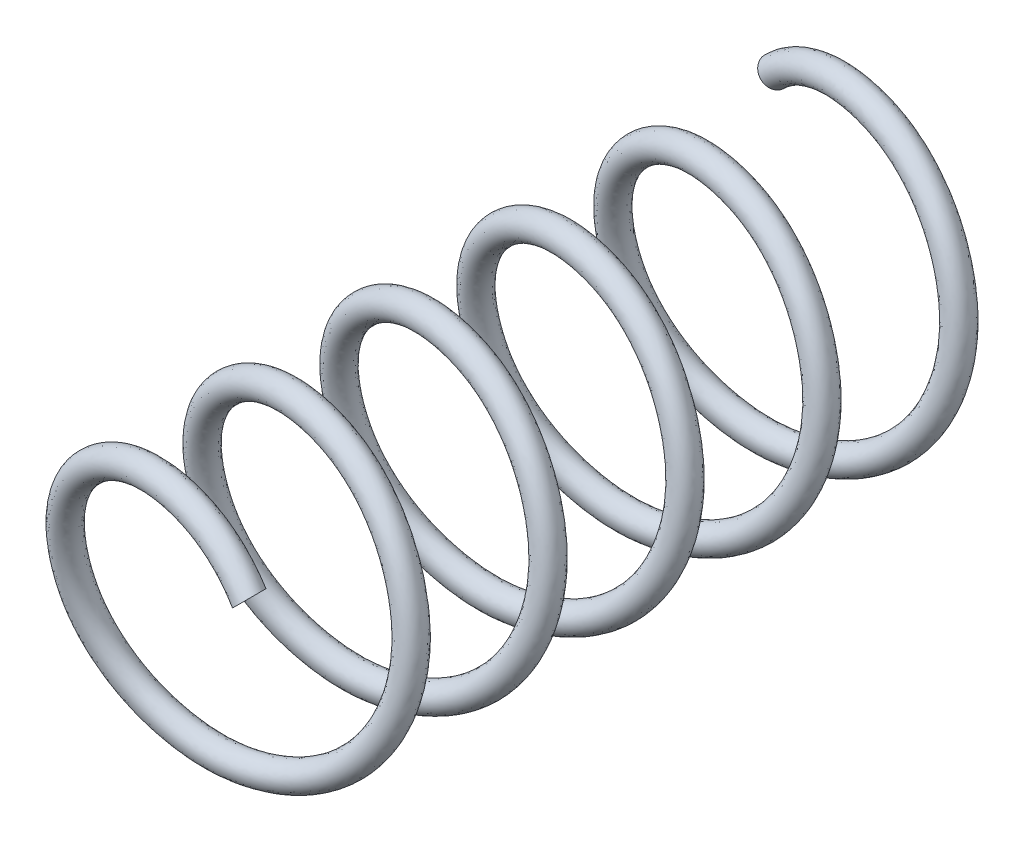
ISO-10303-21;
HEADER;
FILE_DESCRIPTION(('STEP AP214'),'2;1');
FILE_NAME('part.step','',(''),(''),'','','');
FILE_SCHEMA(('AUTOMOTIVE_DESIGN { 1 0 10303 214 1 1 1 1 }'));
ENDSEC;
DATA;
#1=APPLICATION_CONTEXT('core data for automotive mechanical design processes');
#2=APPLICATION_PROTOCOL_DEFINITION('international standard','automotive_design',2000,#1);
#3=PRODUCT_CONTEXT('',#1,'mechanical');
#4=PRODUCT('Part','Part','',(#3));
#5=PRODUCT_RELATED_PRODUCT_CATEGORY('part','',(#4));
#6=PRODUCT_DEFINITION_FORMATION('','',#4);
#7=PRODUCT_DEFINITION_CONTEXT('part definition',#1,'design');
#8=PRODUCT_DEFINITION('design','',#6,#7);
#9=PRODUCT_DEFINITION_SHAPE('','',#8);
#10=(LENGTH_UNIT() NAMED_UNIT(*) SI_UNIT(.MILLI.,.METRE.));
#11=(NAMED_UNIT(*) PLANE_ANGLE_UNIT() SI_UNIT($,.RADIAN.));
#12=(NAMED_UNIT(*) SI_UNIT($,.STERADIAN.) SOLID_ANGLE_UNIT());
#13=UNCERTAINTY_MEASURE_WITH_UNIT(LENGTH_MEASURE(1.E-05),#10,'distance_accuracy_value','');
#14=(GEOMETRIC_REPRESENTATION_CONTEXT(3) GLOBAL_UNCERTAINTY_ASSIGNED_CONTEXT((#13)) GLOBAL_UNIT_ASSIGNED_CONTEXT((#10,
#11,#12)) REPRESENTATION_CONTEXT('',''));
#15=CARTESIAN_POINT('',(0.,0.,0.));
#16=DIRECTION('',(0.,0.,1.));
#17=DIRECTION('',(1.,0.,0.));
#18=AXIS2_PLACEMENT_3D('',#15,#16,#17);
#19=CARTESIAN_POINT('',(-0.777817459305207,0.777817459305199,0.));
#20=DIRECTION('',(0.707106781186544,0.707106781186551,0.));
#21=DIRECTION('',(-0.707106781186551,0.707106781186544,0.));
#22=AXIS2_PLACEMENT_3D('',#19,#20,#21);
#23=PLANE('',#22);
#24=CARTESIAN_POINT('',(-0.636396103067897,0.63639610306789,0.));
#25=CARTESIAN_POINT('',(-0.636396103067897,0.63639610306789,-0.026158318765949));
#26=CARTESIAN_POINT('',(-0.647036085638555,0.647036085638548,-0.1));
#27=CARTESIAN_POINT('',(-0.767177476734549,0.767177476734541,-0.1));
#28=CARTESIAN_POINT('',(-0.777817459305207,0.777817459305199,-0.026158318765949));
#29=CARTESIAN_POINT('',(-0.777817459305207,0.777817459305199,0.0261583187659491));
#30=CARTESIAN_POINT('',(-0.767177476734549,0.767177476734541,0.1));
#31=CARTESIAN_POINT('',(-0.647036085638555,0.647036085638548,0.1));
#32=CARTESIAN_POINT('',(-0.636396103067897,0.63639610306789,0.026158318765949));
#33=CARTESIAN_POINT('',(-0.636396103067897,0.63639610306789,0.));
#34=(BOUNDED_CURVE() B_SPLINE_CURVE(3,(#24,#25,#26,#27,#28,#29,#30,#31,#32,#33),.UNSPECIFIED.,
.T.,.F.) B_SPLINE_CURVE_WITH_KNOTS((4,2,2,2,4),(0.,0.25,0.5,0.75,1.),
.UNSPECIFIED.) CURVE() GEOMETRIC_REPRESENTATION_ITEM() RATIONAL_B_SPLINE_CURVE((1.,1.,
0.68211091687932,0.68211091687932,1.,1.,0.68211091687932,0.68211091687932,1.,1.)) REPRESENTATION_ITEM(''));
#35=CARTESIAN_POINT('',(-0.636396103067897,0.63639610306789,0.));
#36=VERTEX_POINT('',#35);
#37=EDGE_CURVE('E33',#36,#36,#34,.F.);
#38=ORIENTED_EDGE('',*,*,#37,.T.);
#39=EDGE_LOOP('',(#38));
#40=FACE_BOUND('',#39,.T.);
#41=ADVANCED_FACE('F22',(#40),#23,.F.);
#42=CARTESIAN_POINT('',(0.777817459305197,0.77781745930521,5.25));
#43=DIRECTION('',(0.707106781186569,-0.707106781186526,0.));
#44=DIRECTION('',(0.707106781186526,0.707106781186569,0.));
#45=AXIS2_PLACEMENT_3D('',#42,#43,#44);
#46=PLANE('',#45);
#47=CARTESIAN_POINT('',(0.636396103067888,0.636396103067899,5.25));
#48=CARTESIAN_POINT('',(0.636396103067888,0.636396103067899,5.27615831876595));
#49=CARTESIAN_POINT('',(0.647036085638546,0.647036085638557,5.35));
#50=CARTESIAN_POINT('',(0.767177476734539,0.767177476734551,5.35));
#51=CARTESIAN_POINT('',(0.777817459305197,0.77781745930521,5.27615831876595));
#52=CARTESIAN_POINT('',(0.777817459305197,0.77781745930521,5.22384168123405));
#53=CARTESIAN_POINT('',(0.767177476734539,0.767177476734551,5.15));
#54=CARTESIAN_POINT('',(0.647036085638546,0.647036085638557,5.15));
#55=CARTESIAN_POINT('',(0.636396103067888,0.636396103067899,5.22384168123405));
#56=CARTESIAN_POINT('',(0.636396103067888,0.636396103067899,5.25));
#57=(BOUNDED_CURVE() B_SPLINE_CURVE(3,(#47,#48,#49,#50,#51,#52,#53,#54,#55,#56),.UNSPECIFIED.,
.T.,.F.) B_SPLINE_CURVE_WITH_KNOTS((4,2,2,2,4),(0.,0.25,0.5,0.75,1.),
.UNSPECIFIED.) CURVE() GEOMETRIC_REPRESENTATION_ITEM() RATIONAL_B_SPLINE_CURVE((0.933012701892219,
0.933012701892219,0.636418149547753,0.636418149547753,0.933012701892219,0.933012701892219,
0.636418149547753,0.636418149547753,0.933012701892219,0.933012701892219)) REPRESENTATION_ITEM(''));
#58=CARTESIAN_POINT('',(0.636396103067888,0.636396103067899,5.25));
#59=VERTEX_POINT('',#58);
#60=EDGE_CURVE('E10',#59,#59,#57,.F.);
#61=ORIENTED_EDGE('',*,*,#60,.T.);
#62=EDGE_LOOP('',(#61));
#63=FACE_BOUND('',#62,.T.);
#64=ADVANCED_FACE('F24',(#63),#46,.T.);
#65=CARTESIAN_POINT('',(-0.636396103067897,0.63639610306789,0.));
#66=CARTESIAN_POINT('',(-0.268972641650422,1.00381956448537,0.0833333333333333));
#67=CARTESIAN_POINT('',(0.232937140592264,0.869333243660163,0.166666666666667));
#68=CARTESIAN_POINT('',(0.73484692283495,0.734846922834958,0.25));
#69=CARTESIAN_POINT('',(0.869333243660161,0.232937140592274,0.333333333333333));
#70=CARTESIAN_POINT('',(1.00381956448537,-0.268972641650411,0.416666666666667));
#71=CARTESIAN_POINT('',(0.636396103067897,-0.63639610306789,0.5));
#72=CARTESIAN_POINT('',(0.268972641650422,-1.00381956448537,0.583333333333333));
#73=CARTESIAN_POINT('',(-0.232937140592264,-0.869333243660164,0.666666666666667));
#74=CARTESIAN_POINT('',(-0.73484692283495,-0.734846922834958,0.75));
#75=CARTESIAN_POINT('',(-0.869333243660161,-0.232937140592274,0.833333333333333));
#76=CARTESIAN_POINT('',(-1.00381956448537,0.26897264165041,0.916666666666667));
#77=CARTESIAN_POINT('',(-0.636396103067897,0.63639610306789,1.));
#78=CARTESIAN_POINT('',(-0.268972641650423,1.00381956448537,1.08333333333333));
#79=CARTESIAN_POINT('',(0.232937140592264,0.869333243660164,1.16666666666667));
#80=CARTESIAN_POINT('',(0.734846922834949,0.734846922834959,1.25));
#81=CARTESIAN_POINT('',(0.869333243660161,0.232937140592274,1.33333333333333));
#82=CARTESIAN_POINT('',(1.00381956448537,-0.268972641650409,1.41666666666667));
#83=CARTESIAN_POINT('',(0.636396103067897,-0.63639610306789,1.5));
#84=CARTESIAN_POINT('',(0.268972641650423,-1.00381956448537,1.58333333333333));
#85=CARTESIAN_POINT('',(-0.232937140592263,-0.869333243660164,1.66666666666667));
#86=CARTESIAN_POINT('',(-0.73484692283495,-0.734846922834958,1.75));
#87=CARTESIAN_POINT('',(-0.869333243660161,-0.232937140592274,1.83333333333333));
#88=CARTESIAN_POINT('',(-1.00381956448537,0.268972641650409,1.91666666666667));
#89=CARTESIAN_POINT('',(-0.636396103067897,0.63639610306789,2.));
#90=CARTESIAN_POINT('',(-0.268972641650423,1.00381956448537,2.08333333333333));
#91=CARTESIAN_POINT('',(0.232937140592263,0.869333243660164,2.16666666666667));
#92=CARTESIAN_POINT('',(0.734846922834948,0.73484692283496,2.25));
#93=CARTESIAN_POINT('',(0.869333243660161,0.232937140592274,2.33333333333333));
#94=CARTESIAN_POINT('',(1.00381956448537,-0.268972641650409,2.41666666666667));
#95=CARTESIAN_POINT('',(0.636396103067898,-0.636396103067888,2.5));
#96=CARTESIAN_POINT('',(0.268972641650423,-1.00381956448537,2.58333333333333));
#97=CARTESIAN_POINT('',(-0.232937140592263,-0.869333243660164,2.66666666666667));
#98=CARTESIAN_POINT('',(-0.734846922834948,-0.73484692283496,2.75));
#99=CARTESIAN_POINT('',(-0.86933324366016,-0.232937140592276,2.83333333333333));
#100=CARTESIAN_POINT('',(-1.00381956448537,0.268972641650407,2.91666666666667));
#101=CARTESIAN_POINT('',(-0.636396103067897,0.63639610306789,3.));
#102=CARTESIAN_POINT('',(-0.268972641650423,1.00381956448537,3.08333333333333));
#103=CARTESIAN_POINT('',(0.232937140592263,0.869333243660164,3.16666666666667));
#104=CARTESIAN_POINT('',(0.734846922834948,0.73484692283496,3.25));
#105=CARTESIAN_POINT('',(0.86933324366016,0.232937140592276,3.33333333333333));
#106=CARTESIAN_POINT('',(1.00381956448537,-0.268972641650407,3.41666666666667));
#107=CARTESIAN_POINT('',(0.636396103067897,-0.636396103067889,3.5));
#108=CARTESIAN_POINT('',(0.268972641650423,-1.00381956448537,3.58333333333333));
#109=CARTESIAN_POINT('',(-0.232937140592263,-0.869333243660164,3.66666666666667));
#110=CARTESIAN_POINT('',(-0.734846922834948,-0.73484692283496,3.75));
#111=CARTESIAN_POINT('',(-0.86933324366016,-0.232937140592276,3.83333333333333));
#112=CARTESIAN_POINT('',(-1.00381956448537,0.268972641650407,3.91666666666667));
#113=CARTESIAN_POINT('',(-0.636396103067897,0.636396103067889,4.));
#114=CARTESIAN_POINT('',(-0.268972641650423,1.00381956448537,4.08333333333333));
#115=CARTESIAN_POINT('',(0.232937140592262,0.869333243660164,4.16666666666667));
#116=CARTESIAN_POINT('',(0.734846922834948,0.73484692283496,4.25));
#117=CARTESIAN_POINT('',(0.86933324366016,0.232937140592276,4.33333333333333));
#118=CARTESIAN_POINT('',(1.00381956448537,-0.268972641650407,4.41666666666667));
#119=CARTESIAN_POINT('',(0.6363961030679,-0.636396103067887,4.5));
#120=CARTESIAN_POINT('',(0.268972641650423,-1.00381956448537,4.58333333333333));
#121=CARTESIAN_POINT('',(-0.232937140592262,-0.869333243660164,4.66666666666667));
#122=CARTESIAN_POINT('',(-0.734846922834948,-0.73484692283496,4.75));
#123=CARTESIAN_POINT('',(-0.86933324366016,-0.232937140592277,4.83333333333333));
#124=CARTESIAN_POINT('',(-1.00381956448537,0.268972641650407,4.91666666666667));
#125=CARTESIAN_POINT('',(-0.6363961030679,0.636396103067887,5.));
#126=CARTESIAN_POINT('',(-0.268972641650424,1.00381956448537,5.08333333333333));
#127=CARTESIAN_POINT('',(0.232937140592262,0.869333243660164,5.16666666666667));
#128=CARTESIAN_POINT('',(0.465874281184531,0.806917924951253,5.20534180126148));
#129=CARTESIAN_POINT('',(0.636396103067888,0.636396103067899,5.25));
#130=CARTESIAN_POINT('',(-0.636396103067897,0.63639610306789,0.026158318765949));
#131=CARTESIAN_POINT('',(-0.268972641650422,1.00381956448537,0.109491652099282));
#132=CARTESIAN_POINT('',(0.232937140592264,0.869333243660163,0.192824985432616));
#133=CARTESIAN_POINT('',(0.73484692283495,0.734846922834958,0.276158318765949));
#134=CARTESIAN_POINT('',(0.869333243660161,0.232937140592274,0.359491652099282));
#135=CARTESIAN_POINT('',(1.00381956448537,-0.268972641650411,0.442824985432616));
#136=CARTESIAN_POINT('',(0.636396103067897,-0.63639610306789,0.526158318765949));
#137=CARTESIAN_POINT('',(0.268972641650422,-1.00381956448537,0.609491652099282));
#138=CARTESIAN_POINT('',(-0.232937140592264,-0.869333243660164,0.692824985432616));
#139=CARTESIAN_POINT('',(-0.73484692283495,-0.734846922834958,0.776158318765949));
#140=CARTESIAN_POINT('',(-0.869333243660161,-0.232937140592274,0.859491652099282));
#141=CARTESIAN_POINT('',(-1.00381956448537,0.26897264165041,0.942824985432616));
#142=CARTESIAN_POINT('',(-0.636396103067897,0.63639610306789,1.02615831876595));
#143=CARTESIAN_POINT('',(-0.268972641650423,1.00381956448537,1.10949165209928));
#144=CARTESIAN_POINT('',(0.232937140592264,0.869333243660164,1.19282498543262));
#145=CARTESIAN_POINT('',(0.734846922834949,0.734846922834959,1.27615831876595));
#146=CARTESIAN_POINT('',(0.869333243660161,0.232937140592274,1.35949165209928));
#147=CARTESIAN_POINT('',(1.00381956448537,-0.268972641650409,1.44282498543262));
#148=CARTESIAN_POINT('',(0.636396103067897,-0.63639610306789,1.52615831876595));
#149=CARTESIAN_POINT('',(0.268972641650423,-1.00381956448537,1.60949165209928));
#150=CARTESIAN_POINT('',(-0.232937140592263,-0.869333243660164,1.69282498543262));
#151=CARTESIAN_POINT('',(-0.73484692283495,-0.734846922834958,1.77615831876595));
#152=CARTESIAN_POINT('',(-0.869333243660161,-0.232937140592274,1.85949165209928));
#153=CARTESIAN_POINT('',(-1.00381956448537,0.268972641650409,1.94282498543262));
#154=CARTESIAN_POINT('',(-0.636396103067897,0.63639610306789,2.02615831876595));
#155=CARTESIAN_POINT('',(-0.268972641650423,1.00381956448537,2.10949165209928));
#156=CARTESIAN_POINT('',(0.232937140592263,0.869333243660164,2.19282498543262));
#157=CARTESIAN_POINT('',(0.734846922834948,0.73484692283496,2.27615831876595));
#158=CARTESIAN_POINT('',(0.869333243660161,0.232937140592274,2.35949165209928));
#159=CARTESIAN_POINT('',(1.00381956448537,-0.268972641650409,2.44282498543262));
#160=CARTESIAN_POINT('',(0.636396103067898,-0.636396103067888,2.52615831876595));
#161=CARTESIAN_POINT('',(0.268972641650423,-1.00381956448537,2.60949165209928));
#162=CARTESIAN_POINT('',(-0.232937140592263,-0.869333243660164,2.69282498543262));
#163=CARTESIAN_POINT('',(-0.734846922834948,-0.73484692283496,2.77615831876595));
#164=CARTESIAN_POINT('',(-0.86933324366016,-0.232937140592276,2.85949165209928));
#165=CARTESIAN_POINT('',(-1.00381956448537,0.268972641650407,2.94282498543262));
#166=CARTESIAN_POINT('',(-0.636396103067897,0.63639610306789,3.02615831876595));
#167=CARTESIAN_POINT('',(-0.268972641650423,1.00381956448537,3.10949165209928));
#168=CARTESIAN_POINT('',(0.232937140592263,0.869333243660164,3.19282498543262));
#169=CARTESIAN_POINT('',(0.734846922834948,0.73484692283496,3.27615831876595));
#170=CARTESIAN_POINT('',(0.86933324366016,0.232937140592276,3.35949165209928));
#171=CARTESIAN_POINT('',(1.00381956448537,-0.268972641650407,3.44282498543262));
#172=CARTESIAN_POINT('',(0.636396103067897,-0.636396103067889,3.52615831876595));
#173=CARTESIAN_POINT('',(0.268972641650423,-1.00381956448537,3.60949165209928));
#174=CARTESIAN_POINT('',(-0.232937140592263,-0.869333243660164,3.69282498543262));
#175=CARTESIAN_POINT('',(-0.734846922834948,-0.73484692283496,3.77615831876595));
#176=CARTESIAN_POINT('',(-0.86933324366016,-0.232937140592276,3.85949165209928));
#177=CARTESIAN_POINT('',(-1.00381956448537,0.268972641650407,3.94282498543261));
#178=CARTESIAN_POINT('',(-0.636396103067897,0.636396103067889,4.02615831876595));
#179=CARTESIAN_POINT('',(-0.268972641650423,1.00381956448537,4.10949165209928));
#180=CARTESIAN_POINT('',(0.232937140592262,0.869333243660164,4.19282498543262));
#181=CARTESIAN_POINT('',(0.734846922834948,0.73484692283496,4.27615831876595));
#182=CARTESIAN_POINT('',(0.86933324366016,0.232937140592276,4.35949165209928));
#183=CARTESIAN_POINT('',(1.00381956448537,-0.268972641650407,4.44282498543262));
#184=CARTESIAN_POINT('',(0.6363961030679,-0.636396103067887,4.52615831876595));
#185=CARTESIAN_POINT('',(0.268972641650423,-1.00381956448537,4.60949165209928));
#186=CARTESIAN_POINT('',(-0.232937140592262,-0.869333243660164,4.69282498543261));
#187=CARTESIAN_POINT('',(-0.734846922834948,-0.73484692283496,4.77615831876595));
#188=CARTESIAN_POINT('',(-0.86933324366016,-0.232937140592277,4.85949165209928));
#189=CARTESIAN_POINT('',(-1.00381956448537,0.268972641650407,4.94282498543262));
#190=CARTESIAN_POINT('',(-0.6363961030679,0.636396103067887,5.02615831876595));
#191=CARTESIAN_POINT('',(-0.268972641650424,1.00381956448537,5.10949165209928));
#192=CARTESIAN_POINT('',(0.232937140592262,0.869333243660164,5.19282498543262));
#193=CARTESIAN_POINT('',(0.465874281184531,0.806917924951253,5.23150012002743));
#194=CARTESIAN_POINT('',(0.636396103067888,0.636396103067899,5.27615831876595));
#195=CARTESIAN_POINT('',(-0.647036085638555,0.647036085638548,0.1));
#196=CARTESIAN_POINT('',(-0.273469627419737,1.02060254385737,0.183333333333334));
#197=CARTESIAN_POINT('',(0.236831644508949,0.883867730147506,0.266666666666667));
#198=CARTESIAN_POINT('',(0.747132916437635,0.747132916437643,0.35));
#199=CARTESIAN_POINT('',(0.883867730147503,0.236831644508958,0.433333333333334));
#200=CARTESIAN_POINT('',(1.02060254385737,-0.273469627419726,0.516666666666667));
#201=CARTESIAN_POINT('',(0.647036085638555,-0.647036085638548,0.6));
#202=CARTESIAN_POINT('',(0.273469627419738,-1.02060254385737,0.683333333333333));
#203=CARTESIAN_POINT('',(-0.236831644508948,-0.883867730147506,0.766666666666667));
#204=CARTESIAN_POINT('',(-0.747132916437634,-0.747132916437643,0.85));
#205=CARTESIAN_POINT('',(-0.883867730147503,-0.236831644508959,0.933333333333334));
#206=CARTESIAN_POINT('',(-1.02060254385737,0.273469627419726,1.01666666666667));
#207=CARTESIAN_POINT('',(-0.647036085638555,0.647036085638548,1.1));
#208=CARTESIAN_POINT('',(-0.273469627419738,1.02060254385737,1.18333333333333));
#209=CARTESIAN_POINT('',(0.236831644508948,0.883867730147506,1.26666666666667));
#210=CARTESIAN_POINT('',(0.747132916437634,0.747132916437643,1.35));
#211=CARTESIAN_POINT('',(0.883867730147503,0.236831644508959,1.43333333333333));
#212=CARTESIAN_POINT('',(1.02060254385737,-0.273469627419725,1.51666666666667));
#213=CARTESIAN_POINT('',(0.647036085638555,-0.647036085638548,1.6));
#214=CARTESIAN_POINT('',(0.273469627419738,-1.02060254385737,1.68333333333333));
#215=CARTESIAN_POINT('',(-0.236831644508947,-0.883867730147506,1.76666666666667));
#216=CARTESIAN_POINT('',(-0.747132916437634,-0.747132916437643,1.85));
#217=CARTESIAN_POINT('',(-0.883867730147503,-0.236831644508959,1.93333333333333));
#218=CARTESIAN_POINT('',(-1.02060254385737,0.273469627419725,2.01666666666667));
#219=CARTESIAN_POINT('',(-0.647036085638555,0.647036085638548,2.1));
#220=CARTESIAN_POINT('',(-0.273469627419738,1.02060254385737,2.18333333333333));
#221=CARTESIAN_POINT('',(0.236831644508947,0.883867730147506,2.26666666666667));
#222=CARTESIAN_POINT('',(0.747132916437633,0.747132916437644,2.35));
#223=CARTESIAN_POINT('',(0.883867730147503,0.236831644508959,2.43333333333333));
#224=CARTESIAN_POINT('',(1.02060254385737,-0.273469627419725,2.51666666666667));
#225=CARTESIAN_POINT('',(0.647036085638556,-0.647036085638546,2.6));
#226=CARTESIAN_POINT('',(0.273469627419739,-1.02060254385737,2.68333333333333));
#227=CARTESIAN_POINT('',(-0.236831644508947,-0.883867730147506,2.76666666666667));
#228=CARTESIAN_POINT('',(-0.747132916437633,-0.747132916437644,2.85));
#229=CARTESIAN_POINT('',(-0.883867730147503,-0.236831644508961,2.93333333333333));
#230=CARTESIAN_POINT('',(-1.02060254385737,0.273469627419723,3.01666666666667));
#231=CARTESIAN_POINT('',(-0.647036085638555,0.647036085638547,3.1));
#232=CARTESIAN_POINT('',(-0.273469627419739,1.02060254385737,3.18333333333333));
#233=CARTESIAN_POINT('',(0.236831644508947,0.883867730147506,3.26666666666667));
#234=CARTESIAN_POINT('',(0.747132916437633,0.747132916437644,3.35));
#235=CARTESIAN_POINT('',(0.883867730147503,0.236831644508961,3.43333333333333));
#236=CARTESIAN_POINT('',(1.02060254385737,-0.273469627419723,3.51666666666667));
#237=CARTESIAN_POINT('',(0.647036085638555,-0.647036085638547,3.6));
#238=CARTESIAN_POINT('',(0.273469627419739,-1.02060254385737,3.68333333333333));
#239=CARTESIAN_POINT('',(-0.236831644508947,-0.883867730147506,3.76666666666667));
#240=CARTESIAN_POINT('',(-0.747132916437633,-0.747132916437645,3.85));
#241=CARTESIAN_POINT('',(-0.883867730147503,-0.236831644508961,3.93333333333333));
#242=CARTESIAN_POINT('',(-1.02060254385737,0.273469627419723,4.01666666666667));
#243=CARTESIAN_POINT('',(-0.647036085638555,0.647036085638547,4.1));
#244=CARTESIAN_POINT('',(-0.273469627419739,1.02060254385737,4.18333333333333));
#245=CARTESIAN_POINT('',(0.236831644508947,0.883867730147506,4.26666666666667));
#246=CARTESIAN_POINT('',(0.747132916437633,0.747132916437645,4.35));
#247=CARTESIAN_POINT('',(0.883867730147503,0.236831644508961,4.43333333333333));
#248=CARTESIAN_POINT('',(1.02060254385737,-0.273469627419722,4.51666666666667));
#249=CARTESIAN_POINT('',(0.647036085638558,-0.647036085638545,4.6));
#250=CARTESIAN_POINT('',(0.273469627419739,-1.02060254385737,4.68333333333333));
#251=CARTESIAN_POINT('',(-0.236831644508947,-0.883867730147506,4.76666666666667));
#252=CARTESIAN_POINT('',(-0.747132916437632,-0.747132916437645,4.85));
#253=CARTESIAN_POINT('',(-0.883867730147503,-0.236831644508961,4.93333333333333));
#254=CARTESIAN_POINT('',(-1.02060254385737,0.273469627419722,5.01666666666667));
#255=CARTESIAN_POINT('',(-0.647036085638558,0.647036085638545,5.1));
#256=CARTESIAN_POINT('',(-0.273469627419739,1.02060254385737,5.18333333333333));
#257=CARTESIAN_POINT('',(0.236831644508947,0.883867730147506,5.26666666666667));
#258=CARTESIAN_POINT('',(0.4736632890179,0.820408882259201,5.30534180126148));
#259=CARTESIAN_POINT('',(0.647036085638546,0.647036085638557,5.35));
#260=CARTESIAN_POINT('',(-0.767177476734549,0.767177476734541,0.1));
#261=CARTESIAN_POINT('',(-0.324247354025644,1.21010759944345,0.183333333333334));
#262=CARTESIAN_POINT('',(0.280806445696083,1.04798392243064,0.266666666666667));
#263=CARTESIAN_POINT('',(0.88586024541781,0.885860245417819,0.35));
#264=CARTESIAN_POINT('',(1.04798392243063,0.280806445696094,0.433333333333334));
#265=CARTESIAN_POINT('',(1.21010759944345,-0.324247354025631,0.516666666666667));
#266=CARTESIAN_POINT('',(0.767177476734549,-0.767177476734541,0.6));
#267=CARTESIAN_POINT('',(0.324247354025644,-1.21010759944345,0.683333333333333));
#268=CARTESIAN_POINT('',(-0.280806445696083,-1.04798392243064,0.766666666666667));
#269=CARTESIAN_POINT('',(-0.88586024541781,-0.885860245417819,0.85));
#270=CARTESIAN_POINT('',(-1.04798392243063,-0.280806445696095,0.933333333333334));
#271=CARTESIAN_POINT('',(-1.21010759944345,0.324247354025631,1.01666666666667));
#272=CARTESIAN_POINT('',(-0.767177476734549,0.767177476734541,1.1));
#273=CARTESIAN_POINT('',(-0.324247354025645,1.21010759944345,1.18333333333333));
#274=CARTESIAN_POINT('',(0.280806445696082,1.04798392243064,1.26666666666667));
#275=CARTESIAN_POINT('',(0.885860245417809,0.88586024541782,1.35));
#276=CARTESIAN_POINT('',(1.04798392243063,0.280806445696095,1.43333333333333));
#277=CARTESIAN_POINT('',(1.21010759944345,-0.324247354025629,1.51666666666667));
#278=CARTESIAN_POINT('',(0.767177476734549,-0.767177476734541,1.6));
#279=CARTESIAN_POINT('',(0.324247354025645,-1.21010759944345,1.68333333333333));
#280=CARTESIAN_POINT('',(-0.280806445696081,-1.04798392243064,1.76666666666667));
#281=CARTESIAN_POINT('',(-0.88586024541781,-0.88586024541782,1.85));
#282=CARTESIAN_POINT('',(-1.04798392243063,-0.280806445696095,1.93333333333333));
#283=CARTESIAN_POINT('',(-1.21010759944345,0.324247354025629,2.01666666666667));
#284=CARTESIAN_POINT('',(-0.767177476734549,0.767177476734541,2.1));
#285=CARTESIAN_POINT('',(-0.324247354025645,1.21010759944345,2.18333333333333));
#286=CARTESIAN_POINT('',(0.280806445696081,1.04798392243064,2.26666666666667));
#287=CARTESIAN_POINT('',(0.885860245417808,0.885860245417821,2.35));
#288=CARTESIAN_POINT('',(1.04798392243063,0.280806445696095,2.43333333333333));
#289=CARTESIAN_POINT('',(1.21010759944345,-0.324247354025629,2.51666666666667));
#290=CARTESIAN_POINT('',(0.767177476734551,-0.767177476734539,2.6));
#291=CARTESIAN_POINT('',(0.324247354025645,-1.21010759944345,2.68333333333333));
#292=CARTESIAN_POINT('',(-0.280806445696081,-1.04798392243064,2.76666666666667));
#293=CARTESIAN_POINT('',(-0.885860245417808,-0.885860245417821,2.85));
#294=CARTESIAN_POINT('',(-1.04798392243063,-0.280806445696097,2.93333333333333));
#295=CARTESIAN_POINT('',(-1.21010759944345,0.324247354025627,3.01666666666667));
#296=CARTESIAN_POINT('',(-0.76717747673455,0.767177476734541,3.1));
#297=CARTESIAN_POINT('',(-0.324247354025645,1.21010759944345,3.18333333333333));
#298=CARTESIAN_POINT('',(0.280806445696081,1.04798392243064,3.26666666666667));
#299=CARTESIAN_POINT('',(0.885860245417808,0.885860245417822,3.35));
#300=CARTESIAN_POINT('',(1.04798392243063,0.280806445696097,3.43333333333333));
#301=CARTESIAN_POINT('',(1.21010759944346,-0.324247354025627,3.51666666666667));
#302=CARTESIAN_POINT('',(0.76717747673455,-0.76717747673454,3.6));
#303=CARTESIAN_POINT('',(0.324247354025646,-1.21010759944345,3.68333333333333));
#304=CARTESIAN_POINT('',(-0.280806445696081,-1.04798392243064,3.76666666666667));
#305=CARTESIAN_POINT('',(-0.885860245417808,-0.885860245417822,3.85));
#306=CARTESIAN_POINT('',(-1.04798392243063,-0.280806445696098,3.93333333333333));
#307=CARTESIAN_POINT('',(-1.21010759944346,0.324247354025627,4.01666666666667));
#308=CARTESIAN_POINT('',(-0.76717747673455,0.76717747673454,4.1));
#309=CARTESIAN_POINT('',(-0.324247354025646,1.21010759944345,4.18333333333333));
#310=CARTESIAN_POINT('',(0.280806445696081,1.04798392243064,4.26666666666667));
#311=CARTESIAN_POINT('',(0.885860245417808,0.885860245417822,4.35));
#312=CARTESIAN_POINT('',(1.04798392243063,0.280806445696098,4.43333333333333));
#313=CARTESIAN_POINT('',(1.21010759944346,-0.324247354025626,4.51666666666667));
#314=CARTESIAN_POINT('',(0.767177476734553,-0.767177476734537,4.6));
#315=CARTESIAN_POINT('',(0.324247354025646,-1.21010759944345,4.68333333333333));
#316=CARTESIAN_POINT('',(-0.280806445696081,-1.04798392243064,4.76666666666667));
#317=CARTESIAN_POINT('',(-0.885860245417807,-0.885860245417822,4.85));
#318=CARTESIAN_POINT('',(-1.04798392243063,-0.280806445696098,4.93333333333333));
#319=CARTESIAN_POINT('',(-1.21010759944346,0.324247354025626,5.01666666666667));
#320=CARTESIAN_POINT('',(-0.767177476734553,0.767177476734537,5.1));
#321=CARTESIAN_POINT('',(-0.324247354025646,1.21010759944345,5.18333333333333));
#322=CARTESIAN_POINT('',(0.28080644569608,1.04798392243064,5.26666666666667));
#323=CARTESIAN_POINT('',(0.561612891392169,0.972742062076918,5.30534180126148));
#324=CARTESIAN_POINT('',(0.767177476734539,0.767177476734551,5.35));
#325=CARTESIAN_POINT('',(-0.777817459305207,0.777817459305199,0.0261583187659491));
#326=CARTESIAN_POINT('',(-0.32874433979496,1.22689057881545,0.109491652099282));
#327=CARTESIAN_POINT('',(0.284700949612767,1.06251840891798,0.192824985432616));
#328=CARTESIAN_POINT('',(0.898146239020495,0.898146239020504,0.276158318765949));
#329=CARTESIAN_POINT('',(1.06251840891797,0.284700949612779,0.359491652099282));
#330=CARTESIAN_POINT('',(1.22689057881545,-0.328744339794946,0.442824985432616));
#331=CARTESIAN_POINT('',(0.777817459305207,-0.777817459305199,0.526158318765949));
#332=CARTESIAN_POINT('',(0.32874433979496,-1.22689057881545,0.609491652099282));
#333=CARTESIAN_POINT('',(-0.284700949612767,-1.06251840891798,0.692824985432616));
#334=CARTESIAN_POINT('',(-0.898146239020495,-0.898146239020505,0.776158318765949));
#335=CARTESIAN_POINT('',(-1.06251840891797,-0.28470094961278,0.859491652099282));
#336=CARTESIAN_POINT('',(-1.22689057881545,0.328744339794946,0.942824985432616));
#337=CARTESIAN_POINT('',(-0.777817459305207,0.777817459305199,1.02615831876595));
#338=CARTESIAN_POINT('',(-0.328744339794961,1.22689057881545,1.10949165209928));
#339=CARTESIAN_POINT('',(0.284700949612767,1.06251840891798,1.19282498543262));
#340=CARTESIAN_POINT('',(0.898146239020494,0.898146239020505,1.27615831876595));
#341=CARTESIAN_POINT('',(1.06251840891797,0.28470094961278,1.35949165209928));
#342=CARTESIAN_POINT('',(1.22689057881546,-0.328744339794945,1.44282498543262));
#343=CARTESIAN_POINT('',(0.777817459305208,-0.777817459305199,1.52615831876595));
#344=CARTESIAN_POINT('',(0.328744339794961,-1.22689057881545,1.60949165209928));
#345=CARTESIAN_POINT('',(-0.284700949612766,-1.06251840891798,1.69282498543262));
#346=CARTESIAN_POINT('',(-0.898146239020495,-0.898146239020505,1.77615831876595));
#347=CARTESIAN_POINT('',(-1.06251840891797,-0.28470094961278,1.85949165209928));
#348=CARTESIAN_POINT('',(-1.22689057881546,0.328744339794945,1.94282498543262));
#349=CARTESIAN_POINT('',(-0.777817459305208,0.777817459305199,2.02615831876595));
#350=CARTESIAN_POINT('',(-0.328744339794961,1.22689057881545,2.10949165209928));
#351=CARTESIAN_POINT('',(0.284700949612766,1.06251840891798,2.19282498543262));
#352=CARTESIAN_POINT('',(0.898146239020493,0.898146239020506,2.27615831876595));
#353=CARTESIAN_POINT('',(1.06251840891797,0.28470094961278,2.35949165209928));
#354=CARTESIAN_POINT('',(1.22689057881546,-0.328744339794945,2.44282498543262));
#355=CARTESIAN_POINT('',(0.777817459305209,-0.777817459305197,2.52615831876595));
#356=CARTESIAN_POINT('',(0.328744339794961,-1.22689057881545,2.60949165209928));
#357=CARTESIAN_POINT('',(-0.284700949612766,-1.06251840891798,2.69282498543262));
#358=CARTESIAN_POINT('',(-0.898146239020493,-0.898146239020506,2.77615831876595));
#359=CARTESIAN_POINT('',(-1.06251840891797,-0.284700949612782,2.85949165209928));
#360=CARTESIAN_POINT('',(-1.22689057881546,0.328744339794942,2.94282498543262));
#361=CARTESIAN_POINT('',(-0.777817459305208,0.777817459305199,3.02615831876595));
#362=CARTESIAN_POINT('',(-0.328744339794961,1.22689057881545,3.10949165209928));
#363=CARTESIAN_POINT('',(0.284700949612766,1.06251840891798,3.19282498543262));
#364=CARTESIAN_POINT('',(0.898146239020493,0.898146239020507,3.27615831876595));
#365=CARTESIAN_POINT('',(1.06251840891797,0.284700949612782,3.35949165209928));
#366=CARTESIAN_POINT('',(1.22689057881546,-0.328744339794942,3.44282498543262));
#367=CARTESIAN_POINT('',(0.777817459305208,-0.777817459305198,3.52615831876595));
#368=CARTESIAN_POINT('',(0.328744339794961,-1.22689057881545,3.60949165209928));
#369=CARTESIAN_POINT('',(-0.284700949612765,-1.06251840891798,3.69282498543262));
#370=CARTESIAN_POINT('',(-0.898146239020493,-0.898146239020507,3.77615831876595));
#371=CARTESIAN_POINT('',(-1.06251840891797,-0.284700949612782,3.85949165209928));
#372=CARTESIAN_POINT('',(-1.22689057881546,0.328744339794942,3.94282498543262));
#373=CARTESIAN_POINT('',(-0.777817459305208,0.777817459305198,4.02615831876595));
#374=CARTESIAN_POINT('',(-0.328744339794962,1.22689057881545,4.10949165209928));
#375=CARTESIAN_POINT('',(0.284700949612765,1.06251840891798,4.19282498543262));
#376=CARTESIAN_POINT('',(0.898146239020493,0.898146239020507,4.27615831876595));
#377=CARTESIAN_POINT('',(1.06251840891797,0.284700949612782,4.35949165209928));
#378=CARTESIAN_POINT('',(1.22689057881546,-0.328744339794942,4.44282498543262));
#379=CARTESIAN_POINT('',(0.777817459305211,-0.777817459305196,4.52615831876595));
#380=CARTESIAN_POINT('',(0.328744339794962,-1.22689057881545,4.60949165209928));
#381=CARTESIAN_POINT('',(-0.284700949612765,-1.06251840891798,4.69282498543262));
#382=CARTESIAN_POINT('',(-0.898146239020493,-0.898146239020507,4.77615831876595));
#383=CARTESIAN_POINT('',(-1.06251840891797,-0.284700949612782,4.85949165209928));
#384=CARTESIAN_POINT('',(-1.22689057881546,0.328744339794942,4.94282498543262));
#385=CARTESIAN_POINT('',(-0.777817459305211,0.777817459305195,5.02615831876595));
#386=CARTESIAN_POINT('',(-0.328744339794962,1.22689057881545,5.10949165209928));
#387=CARTESIAN_POINT('',(0.284700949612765,1.06251840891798,5.19282498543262));
#388=CARTESIAN_POINT('',(0.569401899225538,0.986233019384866,5.23150012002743));
#389=CARTESIAN_POINT('',(0.777817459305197,0.77781745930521,5.27615831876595));
#390=CARTESIAN_POINT('',(-0.777817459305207,0.777817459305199,-0.026158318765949));
#391=CARTESIAN_POINT('',(-0.32874433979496,1.22689057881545,0.0571750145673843));
#392=CARTESIAN_POINT('',(0.284700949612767,1.06251840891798,0.140508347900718));
#393=CARTESIAN_POINT('',(0.898146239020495,0.898146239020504,0.223841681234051));
#394=CARTESIAN_POINT('',(1.06251840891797,0.284700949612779,0.307175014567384));
#395=CARTESIAN_POINT('',(1.22689057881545,-0.328744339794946,0.390508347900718));
#396=CARTESIAN_POINT('',(0.777817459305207,-0.777817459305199,0.473841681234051));
#397=CARTESIAN_POINT('',(0.32874433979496,-1.22689057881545,0.557175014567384));
#398=CARTESIAN_POINT('',(-0.284700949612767,-1.06251840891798,0.640508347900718));
#399=CARTESIAN_POINT('',(-0.898146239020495,-0.898146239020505,0.723841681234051));
#400=CARTESIAN_POINT('',(-1.06251840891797,-0.28470094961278,0.807175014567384));
#401=CARTESIAN_POINT('',(-1.22689057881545,0.328744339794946,0.890508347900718));
#402=CARTESIAN_POINT('',(-0.777817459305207,0.777817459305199,0.973841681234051));
#403=CARTESIAN_POINT('',(-0.328744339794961,1.22689057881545,1.05717501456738));
#404=CARTESIAN_POINT('',(0.284700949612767,1.06251840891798,1.14050834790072));
#405=CARTESIAN_POINT('',(0.898146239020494,0.898146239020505,1.22384168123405));
#406=CARTESIAN_POINT('',(1.06251840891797,0.28470094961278,1.30717501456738));
#407=CARTESIAN_POINT('',(1.22689057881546,-0.328744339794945,1.39050834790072));
#408=CARTESIAN_POINT('',(0.777817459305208,-0.777817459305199,1.47384168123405));
#409=CARTESIAN_POINT('',(0.328744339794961,-1.22689057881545,1.55717501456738));
#410=CARTESIAN_POINT('',(-0.284700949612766,-1.06251840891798,1.64050834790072));
#411=CARTESIAN_POINT('',(-0.898146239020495,-0.898146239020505,1.72384168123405));
#412=CARTESIAN_POINT('',(-1.06251840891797,-0.28470094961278,1.80717501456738));
#413=CARTESIAN_POINT('',(-1.22689057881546,0.328744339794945,1.89050834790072));
#414=CARTESIAN_POINT('',(-0.777817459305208,0.777817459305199,1.97384168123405));
#415=CARTESIAN_POINT('',(-0.328744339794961,1.22689057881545,2.05717501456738));
#416=CARTESIAN_POINT('',(0.284700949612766,1.06251840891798,2.14050834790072));
#417=CARTESIAN_POINT('',(0.898146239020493,0.898146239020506,2.22384168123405));
#418=CARTESIAN_POINT('',(1.06251840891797,0.28470094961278,2.30717501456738));
#419=CARTESIAN_POINT('',(1.22689057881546,-0.328744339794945,2.39050834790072));
#420=CARTESIAN_POINT('',(0.777817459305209,-0.777817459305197,2.47384168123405));
#421=CARTESIAN_POINT('',(0.328744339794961,-1.22689057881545,2.55717501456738));
#422=CARTESIAN_POINT('',(-0.284700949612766,-1.06251840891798,2.64050834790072));
#423=CARTESIAN_POINT('',(-0.898146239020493,-0.898146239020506,2.72384168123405));
#424=CARTESIAN_POINT('',(-1.06251840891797,-0.284700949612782,2.80717501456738));
#425=CARTESIAN_POINT('',(-1.22689057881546,0.328744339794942,2.89050834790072));
#426=CARTESIAN_POINT('',(-0.777817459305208,0.777817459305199,2.97384168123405));
#427=CARTESIAN_POINT('',(-0.328744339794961,1.22689057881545,3.05717501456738));
#428=CARTESIAN_POINT('',(0.284700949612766,1.06251840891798,3.14050834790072));
#429=CARTESIAN_POINT('',(0.898146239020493,0.898146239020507,3.22384168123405));
#430=CARTESIAN_POINT('',(1.06251840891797,0.284700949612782,3.30717501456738));
#431=CARTESIAN_POINT('',(1.22689057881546,-0.328744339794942,3.39050834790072));
#432=CARTESIAN_POINT('',(0.777817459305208,-0.777817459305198,3.47384168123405));
#433=CARTESIAN_POINT('',(0.328744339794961,-1.22689057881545,3.55717501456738));
#434=CARTESIAN_POINT('',(-0.284700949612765,-1.06251840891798,3.64050834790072));
#435=CARTESIAN_POINT('',(-0.898146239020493,-0.898146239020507,3.72384168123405));
#436=CARTESIAN_POINT('',(-1.06251840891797,-0.284700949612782,3.80717501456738));
#437=CARTESIAN_POINT('',(-1.22689057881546,0.328744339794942,3.89050834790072));
#438=CARTESIAN_POINT('',(-0.777817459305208,0.777817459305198,3.97384168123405));
#439=CARTESIAN_POINT('',(-0.328744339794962,1.22689057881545,4.05717501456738));
#440=CARTESIAN_POINT('',(0.284700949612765,1.06251840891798,4.14050834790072));
#441=CARTESIAN_POINT('',(0.898146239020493,0.898146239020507,4.22384168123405));
#442=CARTESIAN_POINT('',(1.06251840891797,0.284700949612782,4.30717501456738));
#443=CARTESIAN_POINT('',(1.22689057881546,-0.328744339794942,4.39050834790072));
#444=CARTESIAN_POINT('',(0.777817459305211,-0.777817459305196,4.47384168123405));
#445=CARTESIAN_POINT('',(0.328744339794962,-1.22689057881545,4.55717501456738));
#446=CARTESIAN_POINT('',(-0.284700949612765,-1.06251840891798,4.64050834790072));
#447=CARTESIAN_POINT('',(-0.898146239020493,-0.898146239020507,4.72384168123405));
#448=CARTESIAN_POINT('',(-1.06251840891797,-0.284700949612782,4.80717501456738));
#449=CARTESIAN_POINT('',(-1.22689057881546,0.328744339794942,4.89050834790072));
#450=CARTESIAN_POINT('',(-0.777817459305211,0.777817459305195,4.97384168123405));
#451=CARTESIAN_POINT('',(-0.328744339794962,1.22689057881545,5.05717501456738));
#452=CARTESIAN_POINT('',(0.284700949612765,1.06251840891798,5.14050834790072));
#453=CARTESIAN_POINT('',(0.569401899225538,0.986233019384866,5.17918348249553));
#454=CARTESIAN_POINT('',(0.777817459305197,0.77781745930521,5.22384168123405));
#455=CARTESIAN_POINT('',(-0.767177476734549,0.767177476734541,-0.1));
#456=CARTESIAN_POINT('',(-0.324247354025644,1.21010759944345,-0.0166666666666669));
#457=CARTESIAN_POINT('',(0.280806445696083,1.04798392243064,0.0666666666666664));
#458=CARTESIAN_POINT('',(0.88586024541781,0.885860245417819,0.15));
#459=CARTESIAN_POINT('',(1.04798392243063,0.280806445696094,0.233333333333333));
#460=CARTESIAN_POINT('',(1.21010759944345,-0.324247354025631,0.316666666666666));
#461=CARTESIAN_POINT('',(0.767177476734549,-0.767177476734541,0.4));
#462=CARTESIAN_POINT('',(0.324247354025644,-1.21010759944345,0.483333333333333));
#463=CARTESIAN_POINT('',(-0.280806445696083,-1.04798392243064,0.566666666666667));
#464=CARTESIAN_POINT('',(-0.88586024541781,-0.885860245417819,0.65));
#465=CARTESIAN_POINT('',(-1.04798392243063,-0.280806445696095,0.733333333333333));
#466=CARTESIAN_POINT('',(-1.21010759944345,0.324247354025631,0.816666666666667));
#467=CARTESIAN_POINT('',(-0.767177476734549,0.767177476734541,0.9));
#468=CARTESIAN_POINT('',(-0.324247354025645,1.21010759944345,0.983333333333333));
#469=CARTESIAN_POINT('',(0.280806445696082,1.04798392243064,1.06666666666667));
#470=CARTESIAN_POINT('',(0.885860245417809,0.88586024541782,1.15));
#471=CARTESIAN_POINT('',(1.04798392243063,0.280806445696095,1.23333333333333));
#472=CARTESIAN_POINT('',(1.21010759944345,-0.324247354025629,1.31666666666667));
#473=CARTESIAN_POINT('',(0.767177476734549,-0.767177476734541,1.4));
#474=CARTESIAN_POINT('',(0.324247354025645,-1.21010759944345,1.48333333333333));
#475=CARTESIAN_POINT('',(-0.280806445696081,-1.04798392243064,1.56666666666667));
#476=CARTESIAN_POINT('',(-0.88586024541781,-0.88586024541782,1.65));
#477=CARTESIAN_POINT('',(-1.04798392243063,-0.280806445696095,1.73333333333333));
#478=CARTESIAN_POINT('',(-1.21010759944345,0.324247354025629,1.81666666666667));
#479=CARTESIAN_POINT('',(-0.767177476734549,0.767177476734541,1.9));
#480=CARTESIAN_POINT('',(-0.324247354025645,1.21010759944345,1.98333333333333));
#481=CARTESIAN_POINT('',(0.280806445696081,1.04798392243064,2.06666666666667));
#482=CARTESIAN_POINT('',(0.885860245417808,0.885860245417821,2.15));
#483=CARTESIAN_POINT('',(1.04798392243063,0.280806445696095,2.23333333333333));
#484=CARTESIAN_POINT('',(1.21010759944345,-0.324247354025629,2.31666666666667));
#485=CARTESIAN_POINT('',(0.767177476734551,-0.767177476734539,2.4));
#486=CARTESIAN_POINT('',(0.324247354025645,-1.21010759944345,2.48333333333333));
#487=CARTESIAN_POINT('',(-0.280806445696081,-1.04798392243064,2.56666666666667));
#488=CARTESIAN_POINT('',(-0.885860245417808,-0.885860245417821,2.65));
#489=CARTESIAN_POINT('',(-1.04798392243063,-0.280806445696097,2.73333333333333));
#490=CARTESIAN_POINT('',(-1.21010759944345,0.324247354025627,2.81666666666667));
#491=CARTESIAN_POINT('',(-0.76717747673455,0.767177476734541,2.9));
#492=CARTESIAN_POINT('',(-0.324247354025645,1.21010759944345,2.98333333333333));
#493=CARTESIAN_POINT('',(0.280806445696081,1.04798392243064,3.06666666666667));
#494=CARTESIAN_POINT('',(0.885860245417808,0.885860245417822,3.15));
#495=CARTESIAN_POINT('',(1.04798392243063,0.280806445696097,3.23333333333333));
#496=CARTESIAN_POINT('',(1.21010759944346,-0.324247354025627,3.31666666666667));
#497=CARTESIAN_POINT('',(0.76717747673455,-0.76717747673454,3.4));
#498=CARTESIAN_POINT('',(0.324247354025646,-1.21010759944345,3.48333333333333));
#499=CARTESIAN_POINT('',(-0.280806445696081,-1.04798392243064,3.56666666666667));
#500=CARTESIAN_POINT('',(-0.885860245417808,-0.885860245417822,3.65));
#501=CARTESIAN_POINT('',(-1.04798392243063,-0.280806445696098,3.73333333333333));
#502=CARTESIAN_POINT('',(-1.21010759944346,0.324247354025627,3.81666666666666));
#503=CARTESIAN_POINT('',(-0.76717747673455,0.76717747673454,3.9));
#504=CARTESIAN_POINT('',(-0.324247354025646,1.21010759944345,3.98333333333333));
#505=CARTESIAN_POINT('',(0.280806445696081,1.04798392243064,4.06666666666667));
#506=CARTESIAN_POINT('',(0.885860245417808,0.885860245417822,4.15));
#507=CARTESIAN_POINT('',(1.04798392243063,0.280806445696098,4.23333333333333));
#508=CARTESIAN_POINT('',(1.21010759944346,-0.324247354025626,4.31666666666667));
#509=CARTESIAN_POINT('',(0.767177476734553,-0.767177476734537,4.4));
#510=CARTESIAN_POINT('',(0.324247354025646,-1.21010759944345,4.48333333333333));
#511=CARTESIAN_POINT('',(-0.280806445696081,-1.04798392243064,4.56666666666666));
#512=CARTESIAN_POINT('',(-0.885860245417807,-0.885860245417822,4.65));
#513=CARTESIAN_POINT('',(-1.04798392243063,-0.280806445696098,4.73333333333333));
#514=CARTESIAN_POINT('',(-1.21010759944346,0.324247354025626,4.81666666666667));
#515=CARTESIAN_POINT('',(-0.767177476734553,0.767177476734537,4.9));
#516=CARTESIAN_POINT('',(-0.324247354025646,1.21010759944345,4.98333333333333));
#517=CARTESIAN_POINT('',(0.28080644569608,1.04798392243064,5.06666666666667));
#518=CARTESIAN_POINT('',(0.561612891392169,0.972742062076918,5.10534180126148));
#519=CARTESIAN_POINT('',(0.767177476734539,0.767177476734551,5.15));
#520=CARTESIAN_POINT('',(-0.647036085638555,0.647036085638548,-0.1));
#521=CARTESIAN_POINT('',(-0.273469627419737,1.02060254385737,-0.0166666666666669));
#522=CARTESIAN_POINT('',(0.236831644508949,0.883867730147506,0.0666666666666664));
#523=CARTESIAN_POINT('',(0.747132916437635,0.747132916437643,0.15));
#524=CARTESIAN_POINT('',(0.883867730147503,0.236831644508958,0.233333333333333));
#525=CARTESIAN_POINT('',(1.02060254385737,-0.273469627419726,0.316666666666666));
#526=CARTESIAN_POINT('',(0.647036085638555,-0.647036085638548,0.4));
#527=CARTESIAN_POINT('',(0.273469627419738,-1.02060254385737,0.483333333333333));
#528=CARTESIAN_POINT('',(-0.236831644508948,-0.883867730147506,0.566666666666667));
#529=CARTESIAN_POINT('',(-0.747132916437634,-0.747132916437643,0.65));
#530=CARTESIAN_POINT('',(-0.883867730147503,-0.236831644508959,0.733333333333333));
#531=CARTESIAN_POINT('',(-1.02060254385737,0.273469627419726,0.816666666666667));
#532=CARTESIAN_POINT('',(-0.647036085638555,0.647036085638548,0.9));
#533=CARTESIAN_POINT('',(-0.273469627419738,1.02060254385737,0.983333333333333));
#534=CARTESIAN_POINT('',(0.236831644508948,0.883867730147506,1.06666666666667));
#535=CARTESIAN_POINT('',(0.747132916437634,0.747132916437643,1.15));
#536=CARTESIAN_POINT('',(0.883867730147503,0.236831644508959,1.23333333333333));
#537=CARTESIAN_POINT('',(1.02060254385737,-0.273469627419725,1.31666666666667));
#538=CARTESIAN_POINT('',(0.647036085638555,-0.647036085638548,1.4));
#539=CARTESIAN_POINT('',(0.273469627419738,-1.02060254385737,1.48333333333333));
#540=CARTESIAN_POINT('',(-0.236831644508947,-0.883867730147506,1.56666666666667));
#541=CARTESIAN_POINT('',(-0.747132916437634,-0.747132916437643,1.65));
#542=CARTESIAN_POINT('',(-0.883867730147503,-0.236831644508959,1.73333333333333));
#543=CARTESIAN_POINT('',(-1.02060254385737,0.273469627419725,1.81666666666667));
#544=CARTESIAN_POINT('',(-0.647036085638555,0.647036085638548,1.9));
#545=CARTESIAN_POINT('',(-0.273469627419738,1.02060254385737,1.98333333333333));
#546=CARTESIAN_POINT('',(0.236831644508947,0.883867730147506,2.06666666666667));
#547=CARTESIAN_POINT('',(0.747132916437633,0.747132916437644,2.15));
#548=CARTESIAN_POINT('',(0.883867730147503,0.236831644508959,2.23333333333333));
#549=CARTESIAN_POINT('',(1.02060254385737,-0.273469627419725,2.31666666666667));
#550=CARTESIAN_POINT('',(0.647036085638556,-0.647036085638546,2.4));
#551=CARTESIAN_POINT('',(0.273469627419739,-1.02060254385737,2.48333333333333));
#552=CARTESIAN_POINT('',(-0.236831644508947,-0.883867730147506,2.56666666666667));
#553=CARTESIAN_POINT('',(-0.747132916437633,-0.747132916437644,2.65));
#554=CARTESIAN_POINT('',(-0.883867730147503,-0.236831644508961,2.73333333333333));
#555=CARTESIAN_POINT('',(-1.02060254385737,0.273469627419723,2.81666666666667));
#556=CARTESIAN_POINT('',(-0.647036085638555,0.647036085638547,2.9));
#557=CARTESIAN_POINT('',(-0.273469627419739,1.02060254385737,2.98333333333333));
#558=CARTESIAN_POINT('',(0.236831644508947,0.883867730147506,3.06666666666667));
#559=CARTESIAN_POINT('',(0.747132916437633,0.747132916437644,3.15));
#560=CARTESIAN_POINT('',(0.883867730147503,0.236831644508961,3.23333333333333));
#561=CARTESIAN_POINT('',(1.02060254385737,-0.273469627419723,3.31666666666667));
#562=CARTESIAN_POINT('',(0.647036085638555,-0.647036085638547,3.4));
#563=CARTESIAN_POINT('',(0.273469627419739,-1.02060254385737,3.48333333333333));
#564=CARTESIAN_POINT('',(-0.236831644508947,-0.883867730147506,3.56666666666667));
#565=CARTESIAN_POINT('',(-0.747132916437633,-0.747132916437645,3.65));
#566=CARTESIAN_POINT('',(-0.883867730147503,-0.236831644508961,3.73333333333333));
#567=CARTESIAN_POINT('',(-1.02060254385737,0.273469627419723,3.81666666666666));
#568=CARTESIAN_POINT('',(-0.647036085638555,0.647036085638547,3.9));
#569=CARTESIAN_POINT('',(-0.273469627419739,1.02060254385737,3.98333333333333));
#570=CARTESIAN_POINT('',(0.236831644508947,0.883867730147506,4.06666666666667));
#571=CARTESIAN_POINT('',(0.747132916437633,0.747132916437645,4.15));
#572=CARTESIAN_POINT('',(0.883867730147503,0.236831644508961,4.23333333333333));
#573=CARTESIAN_POINT('',(1.02060254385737,-0.273469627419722,4.31666666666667));
#574=CARTESIAN_POINT('',(0.647036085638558,-0.647036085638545,4.4));
#575=CARTESIAN_POINT('',(0.273469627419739,-1.02060254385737,4.48333333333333));
#576=CARTESIAN_POINT('',(-0.236831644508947,-0.883867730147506,4.56666666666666));
#577=CARTESIAN_POINT('',(-0.747132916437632,-0.747132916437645,4.65));
#578=CARTESIAN_POINT('',(-0.883867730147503,-0.236831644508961,4.73333333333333));
#579=CARTESIAN_POINT('',(-1.02060254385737,0.273469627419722,4.81666666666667));
#580=CARTESIAN_POINT('',(-0.647036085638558,0.647036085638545,4.9));
#581=CARTESIAN_POINT('',(-0.273469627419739,1.02060254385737,4.98333333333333));
#582=CARTESIAN_POINT('',(0.236831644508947,0.883867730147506,5.06666666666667));
#583=CARTESIAN_POINT('',(0.4736632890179,0.820408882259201,5.10534180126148));
#584=CARTESIAN_POINT('',(0.647036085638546,0.647036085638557,5.15));
#585=CARTESIAN_POINT('',(-0.636396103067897,0.63639610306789,-0.026158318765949));
#586=CARTESIAN_POINT('',(-0.268972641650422,1.00381956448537,0.0571750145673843));
#587=CARTESIAN_POINT('',(0.232937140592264,0.869333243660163,0.140508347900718));
#588=CARTESIAN_POINT('',(0.73484692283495,0.734846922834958,0.223841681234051));
#589=CARTESIAN_POINT('',(0.869333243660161,0.232937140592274,0.307175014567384));
#590=CARTESIAN_POINT('',(1.00381956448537,-0.268972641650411,0.390508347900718));
#591=CARTESIAN_POINT('',(0.636396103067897,-0.63639610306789,0.473841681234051));
#592=CARTESIAN_POINT('',(0.268972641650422,-1.00381956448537,0.557175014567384));
#593=CARTESIAN_POINT('',(-0.232937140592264,-0.869333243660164,0.640508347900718));
#594=CARTESIAN_POINT('',(-0.73484692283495,-0.734846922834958,0.723841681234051));
#595=CARTESIAN_POINT('',(-0.869333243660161,-0.232937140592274,0.807175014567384));
#596=CARTESIAN_POINT('',(-1.00381956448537,0.26897264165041,0.890508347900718));
#597=CARTESIAN_POINT('',(-0.636396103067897,0.63639610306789,0.973841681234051));
#598=CARTESIAN_POINT('',(-0.268972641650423,1.00381956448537,1.05717501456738));
#599=CARTESIAN_POINT('',(0.232937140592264,0.869333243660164,1.14050834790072));
#600=CARTESIAN_POINT('',(0.734846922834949,0.734846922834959,1.22384168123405));
#601=CARTESIAN_POINT('',(0.869333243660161,0.232937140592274,1.30717501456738));
#602=CARTESIAN_POINT('',(1.00381956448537,-0.268972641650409,1.39050834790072));
#603=CARTESIAN_POINT('',(0.636396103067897,-0.63639610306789,1.47384168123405));
#604=CARTESIAN_POINT('',(0.268972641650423,-1.00381956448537,1.55717501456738));
#605=CARTESIAN_POINT('',(-0.232937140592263,-0.869333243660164,1.64050834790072));
#606=CARTESIAN_POINT('',(-0.73484692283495,-0.734846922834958,1.72384168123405));
#607=CARTESIAN_POINT('',(-0.869333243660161,-0.232937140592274,1.80717501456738));
#608=CARTESIAN_POINT('',(-1.00381956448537,0.268972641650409,1.89050834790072));
#609=CARTESIAN_POINT('',(-0.636396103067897,0.63639610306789,1.97384168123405));
#610=CARTESIAN_POINT('',(-0.268972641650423,1.00381956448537,2.05717501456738));
#611=CARTESIAN_POINT('',(0.232937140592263,0.869333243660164,2.14050834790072));
#612=CARTESIAN_POINT('',(0.734846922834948,0.73484692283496,2.22384168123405));
#613=CARTESIAN_POINT('',(0.869333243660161,0.232937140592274,2.30717501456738));
#614=CARTESIAN_POINT('',(1.00381956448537,-0.268972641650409,2.39050834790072));
#615=CARTESIAN_POINT('',(0.636396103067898,-0.636396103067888,2.47384168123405));
#616=CARTESIAN_POINT('',(0.268972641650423,-1.00381956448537,2.55717501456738));
#617=CARTESIAN_POINT('',(-0.232937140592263,-0.869333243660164,2.64050834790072));
#618=CARTESIAN_POINT('',(-0.734846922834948,-0.73484692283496,2.72384168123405));
#619=CARTESIAN_POINT('',(-0.86933324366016,-0.232937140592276,2.80717501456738));
#620=CARTESIAN_POINT('',(-1.00381956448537,0.268972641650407,2.89050834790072));
#621=CARTESIAN_POINT('',(-0.636396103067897,0.63639610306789,2.97384168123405));
#622=CARTESIAN_POINT('',(-0.268972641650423,1.00381956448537,3.05717501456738));
#623=CARTESIAN_POINT('',(0.232937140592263,0.869333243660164,3.14050834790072));
#624=CARTESIAN_POINT('',(0.734846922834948,0.73484692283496,3.22384168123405));
#625=CARTESIAN_POINT('',(0.86933324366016,0.232937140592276,3.30717501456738));
#626=CARTESIAN_POINT('',(1.00381956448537,-0.268972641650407,3.39050834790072));
#627=CARTESIAN_POINT('',(0.636396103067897,-0.636396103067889,3.47384168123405));
#628=CARTESIAN_POINT('',(0.268972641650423,-1.00381956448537,3.55717501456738));
#629=CARTESIAN_POINT('',(-0.232937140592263,-0.869333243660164,3.64050834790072));
#630=CARTESIAN_POINT('',(-0.734846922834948,-0.73484692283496,3.72384168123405));
#631=CARTESIAN_POINT('',(-0.86933324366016,-0.232937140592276,3.80717501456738));
#632=CARTESIAN_POINT('',(-1.00381956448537,0.268972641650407,3.89050834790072));
#633=CARTESIAN_POINT('',(-0.636396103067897,0.636396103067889,3.97384168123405));
#634=CARTESIAN_POINT('',(-0.268972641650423,1.00381956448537,4.05717501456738));
#635=CARTESIAN_POINT('',(0.232937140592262,0.869333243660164,4.14050834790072));
#636=CARTESIAN_POINT('',(0.734846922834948,0.73484692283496,4.22384168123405));
#637=CARTESIAN_POINT('',(0.86933324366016,0.232937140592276,4.30717501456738));
#638=CARTESIAN_POINT('',(1.00381956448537,-0.268972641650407,4.39050834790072));
#639=CARTESIAN_POINT('',(0.6363961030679,-0.636396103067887,4.47384168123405));
#640=CARTESIAN_POINT('',(0.268972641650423,-1.00381956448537,4.55717501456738));
#641=CARTESIAN_POINT('',(-0.232937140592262,-0.869333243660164,4.64050834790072));
#642=CARTESIAN_POINT('',(-0.734846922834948,-0.73484692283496,4.72384168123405));
#643=CARTESIAN_POINT('',(-0.86933324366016,-0.232937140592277,4.80717501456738));
#644=CARTESIAN_POINT('',(-1.00381956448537,0.268972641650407,4.89050834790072));
#645=CARTESIAN_POINT('',(-0.6363961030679,0.636396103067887,4.97384168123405));
#646=CARTESIAN_POINT('',(-0.268972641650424,1.00381956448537,5.05717501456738));
#647=CARTESIAN_POINT('',(0.232937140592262,0.869333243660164,5.14050834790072));
#648=CARTESIAN_POINT('',(0.465874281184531,0.806917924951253,5.17918348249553));
#649=CARTESIAN_POINT('',(0.636396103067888,0.636396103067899,5.22384168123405));
#650=CARTESIAN_POINT('',(-0.636396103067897,0.63639610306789,0.));
#651=CARTESIAN_POINT('',(-0.268972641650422,1.00381956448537,0.0833333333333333));
#652=CARTESIAN_POINT('',(0.232937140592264,0.869333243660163,0.166666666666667));
#653=CARTESIAN_POINT('',(0.73484692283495,0.734846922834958,0.25));
#654=CARTESIAN_POINT('',(0.869333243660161,0.232937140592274,0.333333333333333));
#655=CARTESIAN_POINT('',(1.00381956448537,-0.268972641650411,0.416666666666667));
#656=CARTESIAN_POINT('',(0.636396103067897,-0.63639610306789,0.5));
#657=CARTESIAN_POINT('',(0.268972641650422,-1.00381956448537,0.583333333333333));
#658=CARTESIAN_POINT('',(-0.232937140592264,-0.869333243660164,0.666666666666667));
#659=CARTESIAN_POINT('',(-0.73484692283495,-0.734846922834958,0.75));
#660=CARTESIAN_POINT('',(-0.869333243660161,-0.232937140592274,0.833333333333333));
#661=CARTESIAN_POINT('',(-1.00381956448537,0.26897264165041,0.916666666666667));
#662=CARTESIAN_POINT('',(-0.636396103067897,0.63639610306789,1.));
#663=CARTESIAN_POINT('',(-0.268972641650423,1.00381956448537,1.08333333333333));
#664=CARTESIAN_POINT('',(0.232937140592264,0.869333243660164,1.16666666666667));
#665=CARTESIAN_POINT('',(0.734846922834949,0.734846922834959,1.25));
#666=CARTESIAN_POINT('',(0.869333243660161,0.232937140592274,1.33333333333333));
#667=CARTESIAN_POINT('',(1.00381956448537,-0.268972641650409,1.41666666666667));
#668=CARTESIAN_POINT('',(0.636396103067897,-0.63639610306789,1.5));
#669=CARTESIAN_POINT('',(0.268972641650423,-1.00381956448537,1.58333333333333));
#670=CARTESIAN_POINT('',(-0.232937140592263,-0.869333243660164,1.66666666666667));
#671=CARTESIAN_POINT('',(-0.73484692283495,-0.734846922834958,1.75));
#672=CARTESIAN_POINT('',(-0.869333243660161,-0.232937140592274,1.83333333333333));
#673=CARTESIAN_POINT('',(-1.00381956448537,0.268972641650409,1.91666666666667));
#674=CARTESIAN_POINT('',(-0.636396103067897,0.63639610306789,2.));
#675=CARTESIAN_POINT('',(-0.268972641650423,1.00381956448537,2.08333333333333));
#676=CARTESIAN_POINT('',(0.232937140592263,0.869333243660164,2.16666666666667));
#677=CARTESIAN_POINT('',(0.734846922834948,0.73484692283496,2.25));
#678=CARTESIAN_POINT('',(0.869333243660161,0.232937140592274,2.33333333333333));
#679=CARTESIAN_POINT('',(1.00381956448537,-0.268972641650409,2.41666666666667));
#680=CARTESIAN_POINT('',(0.636396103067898,-0.636396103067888,2.5));
#681=CARTESIAN_POINT('',(0.268972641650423,-1.00381956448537,2.58333333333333));
#682=CARTESIAN_POINT('',(-0.232937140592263,-0.869333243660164,2.66666666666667));
#683=CARTESIAN_POINT('',(-0.734846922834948,-0.73484692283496,2.75));
#684=CARTESIAN_POINT('',(-0.86933324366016,-0.232937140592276,2.83333333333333));
#685=CARTESIAN_POINT('',(-1.00381956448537,0.268972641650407,2.91666666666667));
#686=CARTESIAN_POINT('',(-0.636396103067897,0.63639610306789,3.));
#687=CARTESIAN_POINT('',(-0.268972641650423,1.00381956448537,3.08333333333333));
#688=CARTESIAN_POINT('',(0.232937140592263,0.869333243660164,3.16666666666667));
#689=CARTESIAN_POINT('',(0.734846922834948,0.73484692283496,3.25));
#690=CARTESIAN_POINT('',(0.86933324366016,0.232937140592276,3.33333333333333));
#691=CARTESIAN_POINT('',(1.00381956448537,-0.268972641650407,3.41666666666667));
#692=CARTESIAN_POINT('',(0.636396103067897,-0.636396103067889,3.5));
#693=CARTESIAN_POINT('',(0.268972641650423,-1.00381956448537,3.58333333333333));
#694=CARTESIAN_POINT('',(-0.232937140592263,-0.869333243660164,3.66666666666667));
#695=CARTESIAN_POINT('',(-0.734846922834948,-0.73484692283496,3.75));
#696=CARTESIAN_POINT('',(-0.86933324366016,-0.232937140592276,3.83333333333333));
#697=CARTESIAN_POINT('',(-1.00381956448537,0.268972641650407,3.91666666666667));
#698=CARTESIAN_POINT('',(-0.636396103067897,0.636396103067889,4.));
#699=CARTESIAN_POINT('',(-0.268972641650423,1.00381956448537,4.08333333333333));
#700=CARTESIAN_POINT('',(0.232937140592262,0.869333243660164,4.16666666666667));
#701=CARTESIAN_POINT('',(0.734846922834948,0.73484692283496,4.25));
#702=CARTESIAN_POINT('',(0.86933324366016,0.232937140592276,4.33333333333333));
#703=CARTESIAN_POINT('',(1.00381956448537,-0.268972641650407,4.41666666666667));
#704=CARTESIAN_POINT('',(0.6363961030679,-0.636396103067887,4.5));
#705=CARTESIAN_POINT('',(0.268972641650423,-1.00381956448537,4.58333333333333));
#706=CARTESIAN_POINT('',(-0.232937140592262,-0.869333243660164,4.66666666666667));
#707=CARTESIAN_POINT('',(-0.734846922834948,-0.73484692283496,4.75));
#708=CARTESIAN_POINT('',(-0.86933324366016,-0.232937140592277,4.83333333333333));
#709=CARTESIAN_POINT('',(-1.00381956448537,0.268972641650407,4.91666666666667));
#710=CARTESIAN_POINT('',(-0.6363961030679,0.636396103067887,5.));
#711=CARTESIAN_POINT('',(-0.268972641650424,1.00381956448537,5.08333333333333));
#712=CARTESIAN_POINT('',(0.232937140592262,0.869333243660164,5.16666666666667));
#713=CARTESIAN_POINT('',(0.465874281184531,0.806917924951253,5.20534180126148));
#714=CARTESIAN_POINT('',(0.636396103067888,0.636396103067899,5.25));
#715=(BOUNDED_SURFACE() B_SPLINE_SURFACE(3,2,((#65,#66,#67,#68,#69,#70,#71,#72,#73,#74,#75,#76,
#77,#78,#79,#80,#81,#82,#83,#84,#85,#86,#87,#88,#89,#90,#91,#92,#93,#94,#95,#96,#97,#98,#99,
#100,#101,#102,#103,#104,#105,#106,#107,#108,#109,#110,#111,#112,#113,#114,#115,#116,#117,#118,
#119,#120,#121,#122,#123,#124,#125,#126,#127,#128,#129),(#130,#131,#132,#133,#134,#135,#136,
#137,#138,#139,#140,#141,#142,#143,#144,#145,#146,#147,#148,#149,#150,#151,#152,#153,#154,#155,
#156,#157,#158,#159,#160,#161,#162,#163,#164,#165,#166,#167,#168,#169,#170,#171,#172,#173,#174,
#175,#176,#177,#178,#179,#180,#181,#182,#183,#184,#185,#186,#187,#188,#189,#190,#191,#192,#193,
#194),(#195,#196,#197,#198,#199,#200,#201,#202,#203,#204,#205,#206,#207,#208,#209,#210,#211,
#212,#213,#214,#215,#216,#217,#218,#219,#220,#221,#222,#223,#224,#225,#226,#227,#228,#229,#230,
#231,#232,#233,#234,#235,#236,#237,#238,#239,#240,#241,#242,#243,#244,#245,#246,#247,#248,#249,
#250,#251,#252,#253,#254,#255,#256,#257,#258,#259),(#260,#261,#262,#263,#264,#265,#266,#267,
#268,#269,#270,#271,#272,#273,#274,#275,#276,#277,#278,#279,#280,#281,#282,#283,#284,#285,#286,
#287,#288,#289,#290,#291,#292,#293,#294,#295,#296,#297,#298,#299,#300,#301,#302,#303,#304,#305,
#306,#307,#308,#309,#310,#311,#312,#313,#314,#315,#316,#317,#318,#319,#320,#321,#322,#323,#324),
(#325,#326,#327,#328,#329,#330,#331,#332,#333,#334,#335,#336,#337,#338,#339,#340,#341,#342,#343,
#344,#345,#346,#347,#348,#349,#350,#351,#352,#353,#354,#355,#356,#357,#358,#359,#360,#361,#362,
#363,#364,#365,#366,#367,#368,#369,#370,#371,#372,#373,#374,#375,#376,#377,#378,#379,#380,#381,
#382,#383,#384,#385,#386,#387,#388,#389),(#390,#391,#392,#393,#394,#395,#396,#397,#398,#399,
#400,#401,#402,#403,#404,#405,#406,#407,#408,#409,#410,#411,#412,#413,#414,#415,#416,#417,#418,
#419,#420,#421,#422,#423,#424,#425,#426,#427,#428,#429,#430,#431,#432,#433,#434,#435,#436,#437,
#438,#439,#440,#441,#442,#443,#444,#445,#446,#447,#448,#449,#450,#451,#452,#453,#454),(#455,
#456,#457,#458,#459,#460,#461,#462,#463,#464,#465,#466,#467,#468,#469,#470,#471,#472,#473,#474,
#475,#476,#477,#478,#479,#480,#481,#482,#483,#484,#485,#486,#487,#488,#489,#490,#491,#492,#493,
#494,#495,#496,#497,#498,#499,#500,#501,#502,#503,#504,#505,#506,#507,#508,#509,#510,#511,#512,
#513,#514,#515,#516,#517,#518,#519),(#520,#521,#522,#523,#524,#525,#526,#527,#528,#529,#530,
#531,#532,#533,#534,#535,#536,#537,#538,#539,#540,#541,#542,#543,#544,#545,#546,#547,#548,#549,
#550,#551,#552,#553,#554,#555,#556,#557,#558,#559,#560,#561,#562,#563,#564,#565,#566,#567,#568,
#569,#570,#571,#572,#573,#574,#575,#576,#577,#578,#579,#580,#581,#582,#583,#584),(#585,#586,
#587,#588,#589,#590,#591,#592,#593,#594,#595,#596,#597,#598,#599,#600,#601,#602,#603,#604,#605,
#606,#607,#608,#609,#610,#611,#612,#613,#614,#615,#616,#617,#618,#619,#620,#621,#622,#623,#624,
#625,#626,#627,#628,#629,#630,#631,#632,#633,#634,#635,#636,#637,#638,#639,#640,#641,#642,#643,
#644,#645,#646,#647,#648,#649),(#650,#651,#652,#653,#654,#655,#656,#657,#658,#659,#660,#661,
#662,#663,#664,#665,#666,#667,#668,#669,#670,#671,#672,#673,#674,#675,#676,#677,#678,#679,#680,
#681,#682,#683,#684,#685,#686,#687,#688,#689,#690,#691,#692,#693,#694,#695,#696,#697,#698,#699,
#700,#701,#702,#703,#704,#705,#706,#707,#708,#709,#710,#711,#712,#713,#714)),.UNSPECIFIED.,.T.,
.F.,.F.) B_SPLINE_SURFACE_WITH_KNOTS((4,2,2,2,4),(3,2,2,2,2,2,2,2,2,2,2,2,2,2,2,2,2,2,2,2,2,2,2,
2,2,2,2,2,2,2,2,2,3),(0.,0.25,0.5,0.75,1.),(0.,0.0277777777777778,0.0555555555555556,
0.0833333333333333,0.111111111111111,0.138888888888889,0.166666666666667,0.194444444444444,
0.222222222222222,0.25,0.277777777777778,0.305555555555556,0.333333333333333,0.361111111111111,
0.388888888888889,0.416666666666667,0.444444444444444,0.472222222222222,0.5,0.527777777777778,
0.555555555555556,0.583333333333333,0.611111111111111,0.638888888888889,0.666666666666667,
0.694444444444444,0.722222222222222,0.75,0.777777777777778,0.805555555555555,0.833333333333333,
0.861111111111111,0.875),
.UNSPECIFIED.) GEOMETRIC_REPRESENTATION_ITEM() RATIONAL_B_SPLINE_SURFACE(((1.,0.866025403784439,
1.,0.866025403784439,1.,0.866025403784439,1.,0.866025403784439,1.,0.866025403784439,1.,
0.866025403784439,1.,0.866025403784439,1.,0.866025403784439,1.,0.866025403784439,1.,
0.866025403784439,1.,0.866025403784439,1.,0.866025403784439,1.,0.866025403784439,1.,
0.866025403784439,1.,0.866025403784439,1.,0.866025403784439,1.,0.866025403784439,1.,
0.866025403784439,1.,0.866025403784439,1.,0.866025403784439,1.,0.866025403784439,1.,
0.866025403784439,1.,0.866025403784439,1.,0.866025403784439,1.,0.866025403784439,1.,
0.866025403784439,1.,0.866025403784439,1.,0.866025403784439,1.,0.866025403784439,1.,
0.866025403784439,1.,0.866025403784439,1.,0.933012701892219,0.933012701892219),(1.,
0.866025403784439,1.,0.866025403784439,1.,0.866025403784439,1.,0.866025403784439,1.,
0.866025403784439,1.,0.866025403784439,1.,0.866025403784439,1.,0.866025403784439,1.,
0.866025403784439,1.,0.866025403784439,1.,0.866025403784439,1.,0.866025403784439,1.,
0.866025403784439,1.,0.866025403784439,1.,0.866025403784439,1.,0.866025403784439,1.,
0.866025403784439,1.,0.866025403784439,1.,0.866025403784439,1.,0.866025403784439,1.,
0.866025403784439,1.,0.866025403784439,1.,0.866025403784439,1.,0.866025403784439,1.,
0.866025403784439,1.,0.866025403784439,1.,0.866025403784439,1.,0.866025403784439,1.,
0.866025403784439,1.,0.866025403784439,1.,0.866025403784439,1.,0.933012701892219,
0.933012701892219),(0.68211091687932,0.590725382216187,0.68211091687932,0.590725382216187,
0.68211091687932,0.590725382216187,0.68211091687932,0.590725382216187,0.68211091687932,
0.590725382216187,0.68211091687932,0.590725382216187,0.68211091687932,0.590725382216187,
0.68211091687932,0.590725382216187,0.68211091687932,0.590725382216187,0.68211091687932,
0.590725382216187,0.68211091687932,0.590725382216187,0.68211091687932,0.590725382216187,
0.68211091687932,0.590725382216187,0.68211091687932,0.590725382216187,0.68211091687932,
0.590725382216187,0.68211091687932,0.590725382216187,0.68211091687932,0.590725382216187,
0.68211091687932,0.590725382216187,0.68211091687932,0.590725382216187,0.68211091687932,
0.590725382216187,0.68211091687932,0.590725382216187,0.68211091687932,0.590725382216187,
0.68211091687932,0.590725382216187,0.68211091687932,0.590725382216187,0.68211091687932,
0.590725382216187,0.68211091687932,0.590725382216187,0.68211091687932,0.590725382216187,
0.68211091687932,0.590725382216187,0.68211091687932,0.590725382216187,0.68211091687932,
0.590725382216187,0.68211091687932,0.590725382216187,0.68211091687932,0.636418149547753,
0.636418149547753),(0.68211091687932,0.590725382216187,0.68211091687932,0.590725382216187,
0.68211091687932,0.590725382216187,0.68211091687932,0.590725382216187,0.68211091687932,
0.590725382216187,0.68211091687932,0.590725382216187,0.68211091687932,0.590725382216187,
0.68211091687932,0.590725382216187,0.68211091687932,0.590725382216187,0.68211091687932,
0.590725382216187,0.68211091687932,0.590725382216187,0.68211091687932,0.590725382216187,
0.68211091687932,0.590725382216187,0.68211091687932,0.590725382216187,0.68211091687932,
0.590725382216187,0.68211091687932,0.590725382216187,0.68211091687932,0.590725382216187,
0.68211091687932,0.590725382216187,0.68211091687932,0.590725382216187,0.68211091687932,
0.590725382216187,0.68211091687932,0.590725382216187,0.68211091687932,0.590725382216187,
0.68211091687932,0.590725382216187,0.68211091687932,0.590725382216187,0.68211091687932,
0.590725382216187,0.68211091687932,0.590725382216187,0.68211091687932,0.590725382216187,
0.68211091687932,0.590725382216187,0.68211091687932,0.590725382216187,0.68211091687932,
0.590725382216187,0.68211091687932,0.590725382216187,0.68211091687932,0.636418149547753,
0.636418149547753),(1.,0.866025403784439,1.,0.866025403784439,1.,0.866025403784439,1.,
0.866025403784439,1.,0.866025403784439,1.,0.866025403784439,1.,0.866025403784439,1.,
0.866025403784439,1.,0.866025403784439,1.,0.866025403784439,1.,0.866025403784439,1.,
0.866025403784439,1.,0.866025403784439,1.,0.866025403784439,1.,0.866025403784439,1.,
0.866025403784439,1.,0.866025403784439,1.,0.866025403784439,1.,0.866025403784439,1.,
0.866025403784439,1.,0.866025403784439,1.,0.866025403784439,1.,0.866025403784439,1.,
0.866025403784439,1.,0.866025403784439,1.,0.866025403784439,1.,0.866025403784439,1.,
0.866025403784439,1.,0.866025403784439,1.,0.866025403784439,1.,0.866025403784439,1.,
0.933012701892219,0.933012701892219),(1.,0.866025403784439,1.,0.866025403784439,1.,
0.866025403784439,1.,0.866025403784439,1.,0.866025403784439,1.,0.866025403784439,1.,
0.866025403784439,1.,0.866025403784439,1.,0.866025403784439,1.,0.866025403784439,1.,
0.866025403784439,1.,0.866025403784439,1.,0.866025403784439,1.,0.866025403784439,1.,
0.866025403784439,1.,0.866025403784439,1.,0.866025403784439,1.,0.866025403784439,1.,
0.866025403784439,1.,0.866025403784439,1.,0.866025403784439,1.,0.866025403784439,1.,
0.866025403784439,1.,0.866025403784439,1.,0.866025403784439,1.,0.866025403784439,1.,
0.866025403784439,1.,0.866025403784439,1.,0.866025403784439,1.,0.866025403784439,1.,
0.866025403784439,1.,0.933012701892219,0.933012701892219),(0.68211091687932,0.590725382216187,
0.68211091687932,0.590725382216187,0.68211091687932,0.590725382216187,0.68211091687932,
0.590725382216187,0.68211091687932,0.590725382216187,0.68211091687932,0.590725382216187,
0.68211091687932,0.590725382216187,0.68211091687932,0.590725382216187,0.68211091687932,
0.590725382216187,0.68211091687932,0.590725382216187,0.68211091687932,0.590725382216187,
0.68211091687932,0.590725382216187,0.68211091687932,0.590725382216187,0.68211091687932,
0.590725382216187,0.68211091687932,0.590725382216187,0.68211091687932,0.590725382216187,
0.68211091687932,0.590725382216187,0.68211091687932,0.590725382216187,0.68211091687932,
0.590725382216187,0.68211091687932,0.590725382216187,0.68211091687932,0.590725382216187,
0.68211091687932,0.590725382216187,0.68211091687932,0.590725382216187,0.68211091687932,
0.590725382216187,0.68211091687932,0.590725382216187,0.68211091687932,0.590725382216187,
0.68211091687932,0.590725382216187,0.68211091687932,0.590725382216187,0.68211091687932,
0.590725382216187,0.68211091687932,0.590725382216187,0.68211091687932,0.590725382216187,
0.68211091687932,0.636418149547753,0.636418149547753),(0.68211091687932,0.590725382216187,
0.68211091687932,0.590725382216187,0.68211091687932,0.590725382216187,0.68211091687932,
0.590725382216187,0.68211091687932,0.590725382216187,0.68211091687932,0.590725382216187,
0.68211091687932,0.590725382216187,0.68211091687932,0.590725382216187,0.68211091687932,
0.590725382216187,0.68211091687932,0.590725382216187,0.68211091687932,0.590725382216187,
0.68211091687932,0.590725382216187,0.68211091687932,0.590725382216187,0.68211091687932,
0.590725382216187,0.68211091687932,0.590725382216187,0.68211091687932,0.590725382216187,
0.68211091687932,0.590725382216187,0.68211091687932,0.590725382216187,0.68211091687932,
0.590725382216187,0.68211091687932,0.590725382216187,0.68211091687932,0.590725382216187,
0.68211091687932,0.590725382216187,0.68211091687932,0.590725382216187,0.68211091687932,
0.590725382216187,0.68211091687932,0.590725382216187,0.68211091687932,0.590725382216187,
0.68211091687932,0.590725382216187,0.68211091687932,0.590725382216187,0.68211091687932,
0.590725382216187,0.68211091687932,0.590725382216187,0.68211091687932,0.590725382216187,
0.68211091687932,0.636418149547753,0.636418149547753),(1.,0.866025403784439,1.,
0.866025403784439,1.,0.866025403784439,1.,0.866025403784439,1.,0.866025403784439,1.,
0.866025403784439,1.,0.866025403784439,1.,0.866025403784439,1.,0.866025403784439,1.,
0.866025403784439,1.,0.866025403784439,1.,0.866025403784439,1.,0.866025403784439,1.,
0.866025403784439,1.,0.866025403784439,1.,0.866025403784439,1.,0.866025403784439,1.,
0.866025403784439,1.,0.866025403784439,1.,0.866025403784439,1.,0.866025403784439,1.,
0.866025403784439,1.,0.866025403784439,1.,0.866025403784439,1.,0.866025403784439,1.,
0.866025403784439,1.,0.866025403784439,1.,0.866025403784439,1.,0.866025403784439,1.,
0.866025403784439,1.,0.866025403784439,1.,0.933012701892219,0.933012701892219),(1.,
0.866025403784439,1.,0.866025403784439,1.,0.866025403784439,1.,0.866025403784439,1.,
0.866025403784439,1.,0.866025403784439,1.,0.866025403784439,1.,0.866025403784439,1.,
0.866025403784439,1.,0.866025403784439,1.,0.866025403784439,1.,0.866025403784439,1.,
0.866025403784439,1.,0.866025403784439,1.,0.866025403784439,1.,0.866025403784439,1.,
0.866025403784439,1.,0.866025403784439,1.,0.866025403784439,1.,0.866025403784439,1.,
0.866025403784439,1.,0.866025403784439,1.,0.866025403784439,1.,0.866025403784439,1.,
0.866025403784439,1.,0.866025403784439,1.,0.866025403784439,1.,0.866025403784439,1.,
0.866025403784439,1.,0.866025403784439,1.,0.866025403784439,1.,0.933012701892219,0.933012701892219))) REPRESENTATION_ITEM('') SURFACE());
#716=ORIENTED_EDGE('',*,*,#37,.F.);
#717=EDGE_LOOP('',(#716));
#718=FACE_BOUND('',#717,.T.);
#719=ORIENTED_EDGE('',*,*,#60,.F.);
#720=EDGE_LOOP('',(#719));
#721=FACE_BOUND('',#720,.T.);
#722=ADVANCED_FACE('F54',(#718,#721),#715,.F.);
#723=CLOSED_SHELL('',(#41,#64,#722));
#724=MANIFOLD_SOLID_BREP('B2',#723);
#725=ADVANCED_BREP_SHAPE_REPRESENTATION('',(#18,#724),#14);
#726=SHAPE_DEFINITION_REPRESENTATION(#9,#725);
ENDSEC;
END-ISO-10303-21;
